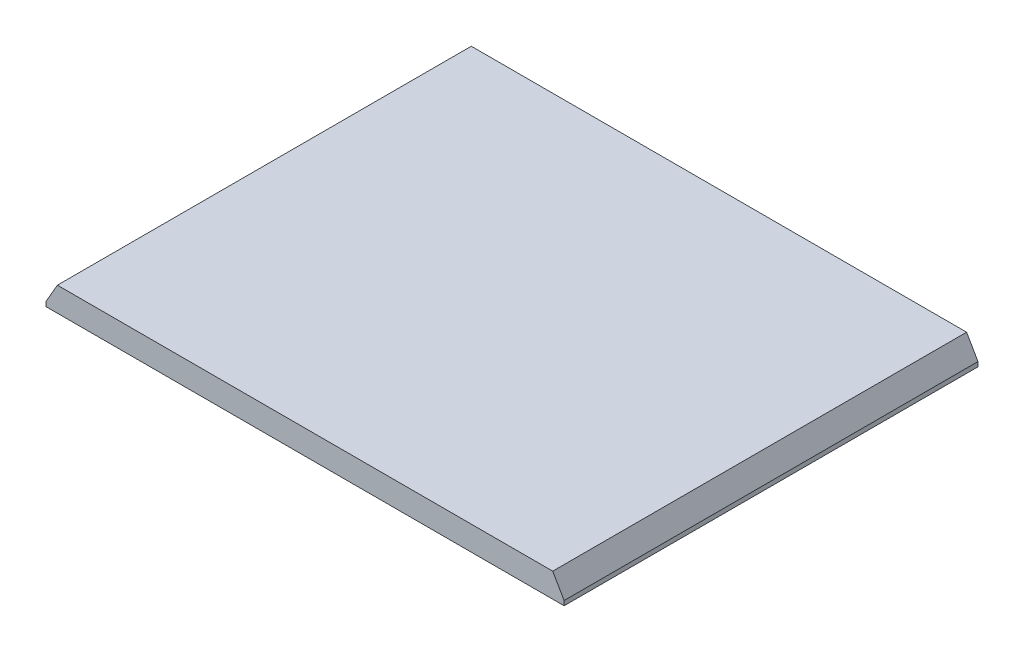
ISO-10303-21;
HEADER;
FILE_DESCRIPTION(('STEP AP214'),'2;1');
FILE_NAME('part.step','',(''),(''),'','','');
FILE_SCHEMA(('AUTOMOTIVE_DESIGN { 1 0 10303 214 1 1 1 1 }'));
ENDSEC;
DATA;
#1=APPLICATION_CONTEXT('core data for automotive mechanical design processes');
#2=APPLICATION_PROTOCOL_DEFINITION('international standard','automotive_design',2000,#1);
#3=PRODUCT_CONTEXT('',#1,'mechanical');
#4=PRODUCT('Part','Part','',(#3));
#5=PRODUCT_RELATED_PRODUCT_CATEGORY('part','',(#4));
#6=PRODUCT_DEFINITION_FORMATION('','',#4);
#7=PRODUCT_DEFINITION_CONTEXT('part definition',#1,'design');
#8=PRODUCT_DEFINITION('design','',#6,#7);
#9=PRODUCT_DEFINITION_SHAPE('','',#8);
#10=(LENGTH_UNIT() NAMED_UNIT(*) SI_UNIT(.MILLI.,.METRE.));
#11=(NAMED_UNIT(*) PLANE_ANGLE_UNIT() SI_UNIT($,.RADIAN.));
#12=(NAMED_UNIT(*) SI_UNIT($,.STERADIAN.) SOLID_ANGLE_UNIT());
#13=UNCERTAINTY_MEASURE_WITH_UNIT(LENGTH_MEASURE(1.E-05),#10,'distance_accuracy_value','');
#14=(GEOMETRIC_REPRESENTATION_CONTEXT(3) GLOBAL_UNCERTAINTY_ASSIGNED_CONTEXT((#13)) GLOBAL_UNIT_ASSIGNED_CONTEXT((#10,
#11,#12)) REPRESENTATION_CONTEXT('',''));
#15=CARTESIAN_POINT('',(0.,0.,0.));
#16=DIRECTION('',(0.,0.,1.));
#17=DIRECTION('',(1.,0.,0.));
#18=AXIS2_PLACEMENT_3D('',#15,#16,#17);
#19=CARTESIAN_POINT('',(541.5415,50.8,432.6));
#20=DIRECTION('',(-1.,0.,0.));
#21=DIRECTION('',(0.,0.,1.));
#22=AXIS2_PLACEMENT_3D('',#19,#20,#21);
#23=PLANE('',#22);
#24=DIRECTION('',(0.,-1.,0.));
#25=VECTOR('',#24,1.);
#26=CARTESIAN_POINT('',(541.5415,50.8,-432.6));
#27=LINE('',#26,#25);
#28=CARTESIAN_POINT('',(541.5415,9.5249999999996,-432.6));
#29=VERTEX_POINT('',#28);
#30=CARTESIAN_POINT('',(541.5415,0.,-432.6));
#31=VERTEX_POINT('',#30);
#32=EDGE_CURVE('E99',#29,#31,#27,.T.);
#33=ORIENTED_EDGE('',*,*,#32,.F.);
#34=DIRECTION('',(0.,0.,1.));
#35=VECTOR('',#34,1.);
#36=CARTESIAN_POINT('',(541.5415,9.5249999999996,432.6));
#37=LINE('',#36,#35);
#38=CARTESIAN_POINT('',(541.5415,9.5249999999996,432.6));
#39=VERTEX_POINT('',#38);
#40=EDGE_CURVE('E11',#29,#39,#37,.T.);
#41=ORIENTED_EDGE('',*,*,#40,.T.);
#42=DIRECTION('',(0.,-1.,0.));
#43=VECTOR('',#42,1.);
#44=CARTESIAN_POINT('',(541.5415,50.8,432.6));
#45=LINE('',#44,#43);
#46=CARTESIAN_POINT('',(541.5415,0.,432.6));
#47=VERTEX_POINT('',#46);
#48=EDGE_CURVE('E125',#39,#47,#45,.T.);
#49=ORIENTED_EDGE('',*,*,#48,.T.);
#50=DIRECTION('',(0.,0.,-1.));
#51=VECTOR('',#50,1.);
#52=CARTESIAN_POINT('',(541.5415,0.,432.6));
#53=LINE('',#52,#51);
#54=EDGE_CURVE('E118',#47,#31,#53,.T.);
#55=ORIENTED_EDGE('',*,*,#54,.T.);
#56=EDGE_LOOP('',(#33,#41,#49,#55));
#57=FACE_BOUND('',#56,.T.);
#58=ADVANCED_FACE('F50',(#57),#23,.F.);
#59=CARTESIAN_POINT('',(541.5415,50.8,-432.6));
#60=DIRECTION('',(0.,0.,1.));
#61=DIRECTION('',(1.,0.,0.));
#62=AXIS2_PLACEMENT_3D('',#59,#60,#61);
#63=PLANE('',#62);
#64=DIRECTION('',(0.,-1.,0.));
#65=VECTOR('',#64,1.);
#66=CARTESIAN_POINT('',(-541.5415,50.8,-432.6));
#67=LINE('',#66,#65);
#68=CARTESIAN_POINT('',(-541.5415,9.5249999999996,-432.6));
#69=VERTEX_POINT('',#68);
#70=CARTESIAN_POINT('',(-541.5415,0.,-432.6));
#71=VERTEX_POINT('',#70);
#72=EDGE_CURVE('E109',#69,#71,#67,.T.);
#73=ORIENTED_EDGE('',*,*,#72,.F.);
#74=DIRECTION('',(0.499999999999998,0.86602540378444,0.));
#75=VECTOR('',#74,1.);
#76=CARTESIAN_POINT('',(-517.711367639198,50.8,-432.6));
#77=LINE('',#76,#75);
#78=CARTESIAN_POINT('',(-517.711367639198,50.8,-432.6));
#79=VERTEX_POINT('',#78);
#80=EDGE_CURVE('E60',#69,#79,#77,.T.);
#81=ORIENTED_EDGE('',*,*,#80,.T.);
#82=DIRECTION('',(-1.,0.,0.));
#83=VECTOR('',#82,1.);
#84=CARTESIAN_POINT('',(541.5415,50.8,-432.6));
#85=LINE('',#84,#83);
#86=CARTESIAN_POINT('',(517.711367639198,50.8,-432.6));
#87=VERTEX_POINT('',#86);
#88=EDGE_CURVE('E134',#87,#79,#85,.T.);
#89=ORIENTED_EDGE('',*,*,#88,.F.);
#90=DIRECTION('',(0.499999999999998,-0.86602540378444,0.));
#91=VECTOR('',#90,1.);
#92=CARTESIAN_POINT('',(517.711367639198,50.8,-432.6));
#93=LINE('',#92,#91);
#94=EDGE_CURVE('E62',#87,#29,#93,.T.);
#95=ORIENTED_EDGE('',*,*,#94,.T.);
#96=ORIENTED_EDGE('',*,*,#32,.T.);
#97=DIRECTION('',(-1.,0.,0.));
#98=VECTOR('',#97,1.);
#99=CARTESIAN_POINT('',(541.5415,0.,-432.6));
#100=LINE('',#99,#98);
#101=EDGE_CURVE('E103',#31,#71,#100,.T.);
#102=ORIENTED_EDGE('',*,*,#101,.T.);
#103=EDGE_LOOP('',(#73,#81,#89,#95,#96,#102));
#104=FACE_BOUND('',#103,.T.);
#105=ADVANCED_FACE('F105',(#104),#63,.F.);
#106=CARTESIAN_POINT('',(-541.5415,50.8,432.6));
#107=DIRECTION('',(1.,0.,0.));
#108=DIRECTION('',(0.,0.,-1.));
#109=AXIS2_PLACEMENT_3D('',#106,#107,#108);
#110=PLANE('',#109);
#111=DIRECTION('',(0.,-1.,0.));
#112=VECTOR('',#111,1.);
#113=CARTESIAN_POINT('',(-541.5415,50.8,432.6));
#114=LINE('',#113,#112);
#115=CARTESIAN_POINT('',(-541.5415,9.5249999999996,432.6));
#116=VERTEX_POINT('',#115);
#117=CARTESIAN_POINT('',(-541.5415,0.,432.6));
#118=VERTEX_POINT('',#117);
#119=EDGE_CURVE('E138',#116,#118,#114,.T.);
#120=ORIENTED_EDGE('',*,*,#119,.F.);
#121=DIRECTION('',(0.,0.,-1.));
#122=VECTOR('',#121,1.);
#123=CARTESIAN_POINT('',(-541.5415,9.5249999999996,-432.6));
#124=LINE('',#123,#122);
#125=EDGE_CURVE('E75',#116,#69,#124,.T.);
#126=ORIENTED_EDGE('',*,*,#125,.T.);
#127=ORIENTED_EDGE('',*,*,#72,.T.);
#128=DIRECTION('',(0.,0.,1.));
#129=VECTOR('',#128,1.);
#130=CARTESIAN_POINT('',(-541.5415,0.,432.6));
#131=LINE('',#130,#129);
#132=EDGE_CURVE('E116',#71,#118,#131,.T.);
#133=ORIENTED_EDGE('',*,*,#132,.T.);
#134=EDGE_LOOP('',(#120,#126,#127,#133));
#135=FACE_BOUND('',#134,.T.);
#136=ADVANCED_FACE('F171',(#135),#110,.F.);
#137=CARTESIAN_POINT('',(541.5415,50.8,432.6));
#138=DIRECTION('',(0.,0.,-1.));
#139=DIRECTION('',(-1.,0.,0.));
#140=AXIS2_PLACEMENT_3D('',#137,#138,#139);
#141=PLANE('',#140);
#142=DIRECTION('',(1.,0.,0.));
#143=VECTOR('',#142,1.);
#144=CARTESIAN_POINT('',(541.5415,50.8,432.6));
#145=LINE('',#144,#143);
#146=CARTESIAN_POINT('',(-517.711367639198,50.8,432.6));
#147=VERTEX_POINT('',#146);
#148=CARTESIAN_POINT('',(517.711367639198,50.8,432.6));
#149=VERTEX_POINT('',#148);
#150=EDGE_CURVE('E130',#147,#149,#145,.T.);
#151=ORIENTED_EDGE('',*,*,#150,.F.);
#152=DIRECTION('',(-0.499999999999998,-0.86602540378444,0.));
#153=VECTOR('',#152,1.);
#154=CARTESIAN_POINT('',(-517.711367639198,50.8,432.6));
#155=LINE('',#154,#153);
#156=EDGE_CURVE('E153',#147,#116,#155,.T.);
#157=ORIENTED_EDGE('',*,*,#156,.T.);
#158=ORIENTED_EDGE('',*,*,#119,.T.);
#159=DIRECTION('',(1.,0.,0.));
#160=VECTOR('',#159,1.);
#161=CARTESIAN_POINT('',(541.5415,0.,432.6));
#162=LINE('',#161,#160);
#163=EDGE_CURVE('E135',#118,#47,#162,.T.);
#164=ORIENTED_EDGE('',*,*,#163,.T.);
#165=ORIENTED_EDGE('',*,*,#48,.F.);
#166=DIRECTION('',(-0.499999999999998,0.86602540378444,0.));
#167=VECTOR('',#166,1.);
#168=CARTESIAN_POINT('',(517.711367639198,50.8,432.6));
#169=LINE('',#168,#167);
#170=EDGE_CURVE('E147',#39,#149,#169,.T.);
#171=ORIENTED_EDGE('',*,*,#170,.T.);
#172=EDGE_LOOP('',(#151,#157,#158,#164,#165,#171));
#173=FACE_BOUND('',#172,.T.);
#174=ADVANCED_FACE('F175',(#173),#141,.F.);
#175=CARTESIAN_POINT('',(0.,50.8,0.));
#176=DIRECTION('',(0.,1.,0.));
#177=DIRECTION('',(0.,0.,1.));
#178=AXIS2_PLACEMENT_3D('',#175,#176,#177);
#179=PLANE('',#178);
#180=ORIENTED_EDGE('',*,*,#88,.T.);
#181=DIRECTION('',(0.,0.,1.));
#182=VECTOR('',#181,1.);
#183=CARTESIAN_POINT('',(-517.711367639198,50.8,432.6));
#184=LINE('',#183,#182);
#185=EDGE_CURVE('E148',#79,#147,#184,.T.);
#186=ORIENTED_EDGE('',*,*,#185,.T.);
#187=ORIENTED_EDGE('',*,*,#150,.T.);
#188=DIRECTION('',(0.,0.,-1.));
#189=VECTOR('',#188,1.);
#190=CARTESIAN_POINT('',(517.711367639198,50.8,-432.6));
#191=LINE('',#190,#189);
#192=EDGE_CURVE('E108',#149,#87,#191,.T.);
#193=ORIENTED_EDGE('',*,*,#192,.T.);
#194=EDGE_LOOP('',(#180,#186,#187,#193));
#195=FACE_BOUND('',#194,.T.);
#196=ADVANCED_FACE('F164',(#195),#179,.T.);
#197=CARTESIAN_POINT('',(0.,0.,0.));
#198=DIRECTION('',(0.,1.,0.));
#199=DIRECTION('',(0.,0.,1.));
#200=AXIS2_PLACEMENT_3D('',#197,#198,#199);
#201=PLANE('',#200);
#202=ORIENTED_EDGE('',*,*,#54,.F.);
#203=ORIENTED_EDGE('',*,*,#163,.F.);
#204=ORIENTED_EDGE('',*,*,#132,.F.);
#205=ORIENTED_EDGE('',*,*,#101,.F.);
#206=EDGE_LOOP('',(#202,#203,#204,#205));
#207=FACE_BOUND('',#206,.T.);
#208=ADVANCED_FACE('F111',(#207),#201,.F.);
#209=CARTESIAN_POINT('',(-517.711367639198,50.8,0.));
#210=DIRECTION('',(-0.86602540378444,0.499999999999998,0.));
#211=DIRECTION('',(0.,0.,-1.));
#212=AXIS2_PLACEMENT_3D('',#209,#210,#211);
#213=PLANE('',#212);
#214=ORIENTED_EDGE('',*,*,#80,.F.);
#215=ORIENTED_EDGE('',*,*,#125,.F.);
#216=ORIENTED_EDGE('',*,*,#156,.F.);
#217=ORIENTED_EDGE('',*,*,#185,.F.);
#218=EDGE_LOOP('',(#214,#215,#216,#217));
#219=FACE_BOUND('',#218,.T.);
#220=ADVANCED_FACE('F168',(#219),#213,.T.);
#221=CARTESIAN_POINT('',(517.711367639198,50.8,0.));
#222=DIRECTION('',(0.86602540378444,0.499999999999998,0.));
#223=DIRECTION('',(0.,0.,1.));
#224=AXIS2_PLACEMENT_3D('',#221,#222,#223);
#225=PLANE('',#224);
#226=ORIENTED_EDGE('',*,*,#170,.F.);
#227=ORIENTED_EDGE('',*,*,#40,.F.);
#228=ORIENTED_EDGE('',*,*,#94,.F.);
#229=ORIENTED_EDGE('',*,*,#192,.F.);
#230=EDGE_LOOP('',(#226,#227,#228,#229));
#231=FACE_BOUND('',#230,.T.);
#232=ADVANCED_FACE('F49',(#231),#225,.T.);
#233=CLOSED_SHELL('',(#58,#105,#136,#174,#196,#208,#220,#232));
#234=MANIFOLD_SOLID_BREP('B2',#233);
#235=ADVANCED_BREP_SHAPE_REPRESENTATION('',(#18,#234),#14);
#236=SHAPE_DEFINITION_REPRESENTATION(#9,#235);
ENDSEC;
END-ISO-10303-21;
